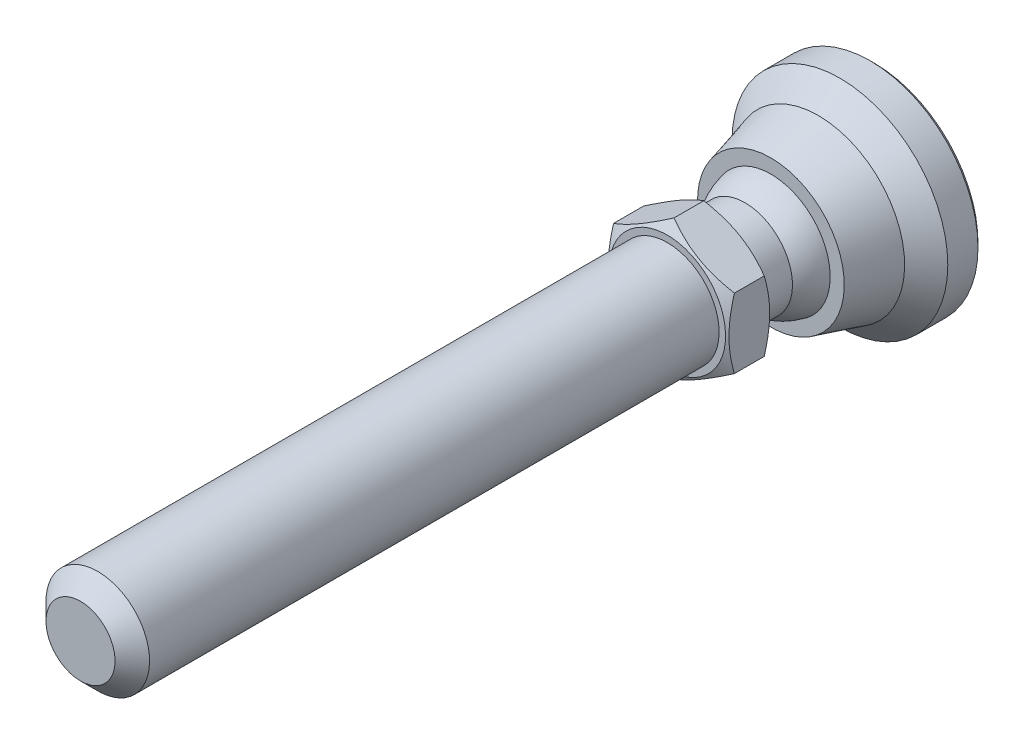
ISO-10303-21;
HEADER;
FILE_DESCRIPTION(('STEP AP214'),'2;1');
FILE_NAME('part.step','',(''),(''),'','','');
FILE_SCHEMA(('AUTOMOTIVE_DESIGN { 1 0 10303 214 1 1 1 1 }'));
ENDSEC;
DATA;
#1=APPLICATION_CONTEXT('core data for automotive mechanical design processes');
#2=APPLICATION_PROTOCOL_DEFINITION('international standard','automotive_design',2000,#1);
#3=PRODUCT_CONTEXT('',#1,'mechanical');
#4=PRODUCT('Part','Part','',(#3));
#5=PRODUCT_RELATED_PRODUCT_CATEGORY('part','',(#4));
#6=PRODUCT_DEFINITION_FORMATION('','',#4);
#7=PRODUCT_DEFINITION_CONTEXT('part definition',#1,'design');
#8=PRODUCT_DEFINITION('design','',#6,#7);
#9=PRODUCT_DEFINITION_SHAPE('','',#8);
#10=(LENGTH_UNIT() NAMED_UNIT(*) SI_UNIT(.MILLI.,.METRE.));
#11=(NAMED_UNIT(*) PLANE_ANGLE_UNIT() SI_UNIT($,.RADIAN.));
#12=(NAMED_UNIT(*) SI_UNIT($,.STERADIAN.) SOLID_ANGLE_UNIT());
#13=UNCERTAINTY_MEASURE_WITH_UNIT(LENGTH_MEASURE(1.E-05),#10,'distance_accuracy_value','');
#14=(GEOMETRIC_REPRESENTATION_CONTEXT(3) GLOBAL_UNCERTAINTY_ASSIGNED_CONTEXT((#13)) GLOBAL_UNIT_ASSIGNED_CONTEXT((#10,
#11,#12)) REPRESENTATION_CONTEXT('',''));
#15=CARTESIAN_POINT('',(0.,0.,0.));
#16=DIRECTION('',(0.,0.,1.));
#17=DIRECTION('',(1.,0.,0.));
#18=AXIS2_PLACEMENT_3D('',#15,#16,#17);
#19=CARTESIAN_POINT('',(1.11022302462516E-13,0.,10.6698729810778));
#20=DIRECTION('',(0.,0.,-1.));
#21=DIRECTION('',(-1.,0.,0.));
#22=AXIS2_PLACEMENT_3D('',#19,#20,#21);
#23=SPHERICAL_SURFACE('',#22,7.);
#24=CARTESIAN_POINT('',(0.,0.,12.));
#25=DIRECTION('',(0.,0.,-1.));
#26=DIRECTION('',(0.,1.,0.));
#27=AXIS2_PLACEMENT_3D('',#24,#25,#26);
#28=CIRCLE('',#27,6.87246404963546);
#29=CARTESIAN_POINT('',(-6.87246404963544,0.,12.));
#30=VERTEX_POINT('',#29);
#31=EDGE_CURVE('E27',#30,#30,#28,.T.);
#32=CARTESIAN_POINT('',(0.,0.,15.));
#33=DIRECTION('',(0.,0.,-1.));
#34=DIRECTION('',(0.,1.,0.));
#35=AXIS2_PLACEMENT_3D('',#32,#33,#34);
#36=CIRCLE('',#35,5.49999999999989);
#37=CARTESIAN_POINT('',(-5.49999999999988,0.,15.));
#38=VERTEX_POINT('',#37);
#39=EDGE_CURVE('E95',#38,#38,#36,.T.);
#40=CARTESIAN_POINT('',(-6.87246404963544,0.,12.));
#41=CARTESIAN_POINT('',(-6.86587210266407,0.,12.0340591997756));
#42=CARTESIAN_POINT('',(-6.85902692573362,0.,12.0680693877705));
#43=CARTESIAN_POINT('',(-6.84483171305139,0.,12.1359842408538));
#44=CARTESIAN_POINT('',(-6.83748167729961,0.,12.1698889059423));
#45=CARTESIAN_POINT('',(-6.82227834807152,0.,12.2375852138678));
#46=CARTESIAN_POINT('',(-6.81442505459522,0.,12.2713768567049));
#47=CARTESIAN_POINT('',(-6.79821695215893,0.,12.3388396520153));
#48=CARTESIAN_POINT('',(-6.78986214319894,0.,12.3725108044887));
#49=CARTESIAN_POINT('',(-6.77265285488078,0.,12.4397251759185));
#50=CARTESIAN_POINT('',(-6.76379837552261,0.,12.473268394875));
#51=CARTESIAN_POINT('',(-6.7455917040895,0.,12.5402194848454));
#52=CARTESIAN_POINT('',(-6.73623951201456,0.,12.5736273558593));
#53=CARTESIAN_POINT('',(-6.71703948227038,0.,12.6403003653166));
#54=CARTESIAN_POINT('',(-6.70719164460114,0.,12.67356550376));
#55=CARTESIAN_POINT('',(-6.68700250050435,0.,12.7399456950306));
#56=CARTESIAN_POINT('',(-6.6766611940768,0.,12.7730607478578));
#57=CARTESIAN_POINT('',(-6.65548739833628,0.,12.8391334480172));
#58=CARTESIAN_POINT('',(-6.64465490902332,0.,12.8720910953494));
#59=CARTESIAN_POINT('',(-6.62250114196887,0.,12.9378416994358));
#60=CARTESIAN_POINT('',(-6.61117986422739,0.,12.9706346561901));
#61=CARTESIAN_POINT('',(-6.58805102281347,0.,13.0360486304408));
#62=CARTESIAN_POINT('',(-6.57624345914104,0.,13.0686696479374));
#63=CARTESIAN_POINT('',(-6.55214465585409,0.,13.1337325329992));
#64=CARTESIAN_POINT('',(-6.53985341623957,0.,13.1661744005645));
#65=CARTESIAN_POINT('',(-6.51478997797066,0.,13.2308718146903));
#66=CARTESIAN_POINT('',(-6.50201777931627,0.,13.2631273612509));
#67=CARTESIAN_POINT('',(-6.47599524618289,0.,13.3274450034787));
#68=CARTESIAN_POINT('',(-6.46274491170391,0.,13.3595070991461));
#69=CARTESIAN_POINT('',(-6.43576903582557,0.,13.4234307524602));
#70=CARTESIAN_POINT('',(-6.42204349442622,0.,13.455292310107));
#71=CARTESIAN_POINT('',(-6.3941202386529,0.,13.5188078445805));
#72=CARTESIAN_POINT('',(-6.37992252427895,0.,13.5504618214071));
#73=CARTESIAN_POINT('',(-6.3510580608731,0.,13.6135551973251));
#74=CARTESIAN_POINT('',(-6.33639131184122,0.,13.6449945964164));
#75=CARTESIAN_POINT('',(-6.3065920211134,0.,13.7076518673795));
#76=CARTESIAN_POINT('',(-6.29145947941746,0.,13.7388697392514));
#77=CARTESIAN_POINT('',(-6.26073194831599,0.,13.8010770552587));
#78=CARTESIAN_POINT('',(-6.24513695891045,0.,13.8320664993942));
#79=CARTESIAN_POINT('',(-6.21348797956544,0.,13.8938101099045));
#80=CARTESIAN_POINT('',(-6.19743398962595,0.,13.9245642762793));
#81=CARTESIAN_POINT('',(-6.16487055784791,0.,13.9858305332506));
#82=CARTESIAN_POINT('',(-6.14836111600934,0.,14.016342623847));
#83=CARTESIAN_POINT('',(-6.11489042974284,0.,14.0771179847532));
#84=CARTESIAN_POINT('',(-6.09792918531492,0.,14.107381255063));
#85=CARTESIAN_POINT('',(-6.06355864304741,0.,14.1676522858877));
#86=CARTESIAN_POINT('',(-6.04614934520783,0.,14.1976600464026));
#87=CARTESIAN_POINT('',(-6.01088654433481,0.,14.2574134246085));
#88=CARTESIAN_POINT('',(-5.99303304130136,0.,14.2871590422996));
#89=CARTESIAN_POINT('',(-5.95688577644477,0.,14.3463815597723));
#90=CARTESIAN_POINT('',(-5.93859201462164,0.,14.3758584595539));
#91=CARTESIAN_POINT('',(-5.9015682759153,0.,14.4345370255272));
#92=CARTESIAN_POINT('',(-5.88283829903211,0.,14.4637386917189));
#93=CARTESIAN_POINT('',(-5.8449462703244,0.,14.5218603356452));
#94=CARTESIAN_POINT('',(-5.82578421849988,0.,14.5507803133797));
#95=CARTESIAN_POINT('',(-5.7870322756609,0.,14.6083321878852));
#96=CARTESIAN_POINT('',(-5.76744238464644,0.,14.6369640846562));
#97=CARTESIAN_POINT('',(-5.72783909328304,0.,14.6939334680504));
#98=CARTESIAN_POINT('',(-5.7078256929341,0.,14.7222709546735));
#99=CARTESIAN_POINT('',(-5.66737980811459,0.,14.778645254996));
#100=CARTESIAN_POINT('',(-5.64694732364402,0.,14.8066820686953));
#101=CARTESIAN_POINT('',(-5.60566778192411,0.,14.862448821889));
#102=CARTESIAN_POINT('',(-5.58482072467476,0.,14.8901787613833));
#103=CARTESIAN_POINT('',(-5.54271666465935,0.,14.9453256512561));
#104=CARTESIAN_POINT('',(-5.52145966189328,0.,14.9727426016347));
#105=CARTESIAN_POINT('',(-5.49999999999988,0.,15.));
#106=B_SPLINE_CURVE_WITH_KNOTS('',3,(#40,#41,#42,#43,#44,#45,#46,#47,#48,#49,#50,#51,#52,#53,
#54,#55,#56,#57,#58,#59,#60,#61,#62,#63,#64,#65,#66,#67,#68,#69,#70,#71,#72,#73,#74,#75,#76,#77,
#78,#79,#80,#81,#82,#83,#84,#85,#86,#87,#88,#89,#90,#91,#92,#93,#94,#95,#96,#97,#98,#99,#100,
#101,#102,#103,#104,#105),.UNSPECIFIED.,.F.,.F.,(4,2,2,2,2,2,2,2,2,2,2,2,2,2,2,2,2,2,2,2,2,2,2,
2,2,2,2,2,2,2,2,2,4),(0.,0.104072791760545,0.208145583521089,0.312218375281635,
0.416291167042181,0.520363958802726,0.62443675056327,0.728509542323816,0.83258233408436,
0.936655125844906,1.04072791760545,1.144800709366,1.24887350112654,1.35294629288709,
1.45701908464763,1.56109187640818,1.66516466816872,1.76923745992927,1.87331025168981,
1.97738304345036,2.0814558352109,2.18552862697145,2.28960141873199,2.39367421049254,
2.49774700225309,2.60181979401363,2.70589258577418,2.80996537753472,2.91403816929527,
3.01811096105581,3.12218375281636,3.2262565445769,3.33032933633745),.UNSPECIFIED.);
#107=EDGE_CURVE('BSEAM14',#30,#38,#106,.T.);
#108=ORIENTED_EDGE('',*,*,#31,.F.);
#109=ORIENTED_EDGE('',*,*,#39,.T.);
#110=ORIENTED_EDGE('',*,*,#107,.T.);
#111=ORIENTED_EDGE('',*,*,#107,.F.);
#112=EDGE_LOOP('',(#108,#110,#109,#111));
#113=FACE_BOUND('',#112,.T.);
#114=ADVANCED_FACE('F14',(#113),#23,.T.);
#115=CARTESIAN_POINT('',(-8.5,0.,12.));
#116=DIRECTION('',(0.,0.,-1.));
#117=DIRECTION('',(0.,1.,0.));
#118=AXIS2_PLACEMENT_3D('',#115,#116,#117);
#119=PLANE('',#118);
#120=CARTESIAN_POINT('',(0.,0.,12.));
#121=DIRECTION('',(0.,0.,-1.));
#122=DIRECTION('',(0.,1.,0.));
#123=AXIS2_PLACEMENT_3D('',#120,#121,#122);
#124=CIRCLE('',#123,8.5);
#125=CARTESIAN_POINT('',(0.,8.5,12.));
#126=VERTEX_POINT('',#125);
#127=EDGE_CURVE('E122',#126,#126,#124,.T.);
#128=ORIENTED_EDGE('',*,*,#127,.F.);
#129=EDGE_LOOP('',(#128));
#130=FACE_BOUND('',#129,.T.);
#131=ORIENTED_EDGE('',*,*,#31,.T.);
#132=EDGE_LOOP('',(#131));
#133=FACE_BOUND('',#132,.T.);
#134=ADVANCED_FACE('F127',(#130,#133),#119,.F.);
#135=CARTESIAN_POINT('',(0.,0.,12.));
#136=DIRECTION('',(0.,0.,-1.));
#137=DIRECTION('',(0.,1.,0.));
#138=AXIS2_PLACEMENT_3D('',#135,#136,#137);
#139=CONICAL_SURFACE('',#138,8.5,0.266252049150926);
#140=CARTESIAN_POINT('',(0.,0.,6.5));
#141=DIRECTION('',(0.,0.,-1.));
#142=DIRECTION('',(0.,1.,0.));
#143=AXIS2_PLACEMENT_3D('',#140,#141,#142);
#144=CIRCLE('',#143,10.);
#145=CARTESIAN_POINT('',(0.,10.,6.5));
#146=VERTEX_POINT('',#145);
#147=EDGE_CURVE('E119',#146,#146,#144,.T.);
#148=ORIENTED_EDGE('',*,*,#147,.F.);
#149=EDGE_LOOP('',(#148));
#150=FACE_BOUND('',#149,.T.);
#151=ORIENTED_EDGE('',*,*,#127,.T.);
#152=EDGE_LOOP('',(#151));
#153=FACE_BOUND('',#152,.T.);
#154=ADVANCED_FACE('F182',(#150,#153),#139,.T.);
#155=CARTESIAN_POINT('',(0.,0.,6.5));
#156=DIRECTION('',(0.,0.,-1.));
#157=DIRECTION('',(0.,1.,0.));
#158=AXIS2_PLACEMENT_3D('',#155,#156,#157);
#159=CONICAL_SURFACE('',#158,10.,0.785398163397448);
#160=CARTESIAN_POINT('',(0.,0.,4.));
#161=DIRECTION('',(0.,0.,-1.));
#162=DIRECTION('',(0.,1.,0.));
#163=AXIS2_PLACEMENT_3D('',#160,#161,#162);
#164=CIRCLE('',#163,12.5);
#165=CARTESIAN_POINT('',(0.,12.5,4.));
#166=VERTEX_POINT('',#165);
#167=EDGE_CURVE('E116',#166,#166,#164,.T.);
#168=ORIENTED_EDGE('',*,*,#167,.F.);
#169=EDGE_LOOP('',(#168));
#170=FACE_BOUND('',#169,.T.);
#171=ORIENTED_EDGE('',*,*,#147,.T.);
#172=EDGE_LOOP('',(#171));
#173=FACE_BOUND('',#172,.T.);
#174=ADVANCED_FACE('F178',(#170,#173),#159,.T.);
#175=CARTESIAN_POINT('',(0.,0.,0.));
#176=DIRECTION('',(0.,0.,-1.));
#177=DIRECTION('',(0.,1.,0.));
#178=AXIS2_PLACEMENT_3D('',#175,#176,#177);
#179=CYLINDRICAL_SURFACE('',#178,12.5);
#180=CARTESIAN_POINT('',(0.,0.,0.5));
#181=DIRECTION('',(0.,0.,-1.));
#182=DIRECTION('',(0.,1.,0.));
#183=AXIS2_PLACEMENT_3D('',#180,#181,#182);
#184=CIRCLE('',#183,12.5);
#185=CARTESIAN_POINT('',(0.,12.5,0.5));
#186=VERTEX_POINT('',#185);
#187=EDGE_CURVE('E113',#186,#186,#184,.T.);
#188=ORIENTED_EDGE('',*,*,#187,.F.);
#189=EDGE_LOOP('',(#188));
#190=FACE_BOUND('',#189,.T.);
#191=ORIENTED_EDGE('',*,*,#167,.T.);
#192=EDGE_LOOP('',(#191));
#193=FACE_BOUND('',#192,.T.);
#194=ADVANCED_FACE('F174',(#190,#193),#179,.T.);
#195=CARTESIAN_POINT('',(0.,0.,0.5));
#196=DIRECTION('',(0.,0.,1.));
#197=DIRECTION('',(0.,-1.,0.));
#198=AXIS2_PLACEMENT_3D('',#195,#196,#197);
#199=CONICAL_SURFACE('',#198,12.5,0.785398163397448);
#200=CARTESIAN_POINT('',(0.,0.,0.));
#201=DIRECTION('',(0.,0.,-1.));
#202=DIRECTION('',(0.,1.,0.));
#203=AXIS2_PLACEMENT_3D('',#200,#201,#202);
#204=CIRCLE('',#203,12.);
#205=CARTESIAN_POINT('',(0.,12.,0.));
#206=VERTEX_POINT('',#205);
#207=EDGE_CURVE('E110',#206,#206,#204,.T.);
#208=ORIENTED_EDGE('',*,*,#207,.F.);
#209=EDGE_LOOP('',(#208));
#210=FACE_BOUND('',#209,.T.);
#211=ORIENTED_EDGE('',*,*,#187,.T.);
#212=EDGE_LOOP('',(#211));
#213=FACE_BOUND('',#212,.T.);
#214=ADVANCED_FACE('F149',(#210,#213),#199,.T.);
#215=CARTESIAN_POINT('',(-12.,0.,0.));
#216=DIRECTION('',(0.,0.,1.));
#217=DIRECTION('',(0.,-1.,0.));
#218=AXIS2_PLACEMENT_3D('',#215,#216,#217);
#219=PLANE('',#218);
#220=ORIENTED_EDGE('',*,*,#207,.T.);
#221=EDGE_LOOP('',(#220));
#222=FACE_BOUND('',#221,.T.);
#223=ADVANCED_FACE('F141',(#222),#219,.F.);
#224=CARTESIAN_POINT('',(-5.49999999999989,0.,18.9999999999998));
#225=DIRECTION('',(0.,0.,1.));
#226=DIRECTION('',(0.,-1.,0.));
#227=AXIS2_PLACEMENT_3D('',#224,#225,#226);
#228=PLANE('',#227);
#229=CARTESIAN_POINT('',(0.,0.,18.9999999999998));
#230=DIRECTION('',(0.,0.,1.));
#231=DIRECTION('',(0.,-1.,0.));
#232=AXIS2_PLACEMENT_3D('',#229,#230,#231);
#233=CIRCLE('',#232,6.75);
#234=CARTESIAN_POINT('',(0.,-6.75,18.9999999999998));
#235=VERTEX_POINT('',#234);
#236=EDGE_CURVE('E427',#235,#235,#233,.T.);
#237=ORIENTED_EDGE('',*,*,#236,.F.);
#238=EDGE_LOOP('',(#237));
#239=FACE_BOUND('',#238,.T.);
#240=CARTESIAN_POINT('',(0.,0.,18.9999999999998));
#241=DIRECTION('',(0.,0.,-1.));
#242=DIRECTION('',(0.,1.,0.));
#243=AXIS2_PLACEMENT_3D('',#240,#241,#242);
#244=CIRCLE('',#243,5.49999999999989);
#245=CARTESIAN_POINT('',(0.,5.49999999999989,18.9999999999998));
#246=VERTEX_POINT('',#245);
#247=EDGE_CURVE('E98',#246,#246,#244,.T.);
#248=ORIENTED_EDGE('',*,*,#247,.F.);
#249=EDGE_LOOP('',(#248));
#250=FACE_BOUND('',#249,.T.);
#251=ADVANCED_FACE('F136',(#239,#250),#228,.F.);
#252=CARTESIAN_POINT('',(0.,0.,0.));
#253=DIRECTION('',(0.,0.,-1.));
#254=DIRECTION('',(0.,1.,0.));
#255=AXIS2_PLACEMENT_3D('',#252,#253,#254);
#256=CYLINDRICAL_SURFACE('',#255,5.49999999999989);
#257=ORIENTED_EDGE('',*,*,#39,.F.);
#258=EDGE_LOOP('',(#257));
#259=FACE_BOUND('',#258,.T.);
#260=ORIENTED_EDGE('',*,*,#247,.T.);
#261=EDGE_LOOP('',(#260));
#262=FACE_BOUND('',#261,.T.);
#263=ADVANCED_FACE('F133',(#259,#262),#256,.T.);
#264=CARTESIAN_POINT('',(0.,0.,18.9999999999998));
#265=DIRECTION('',(0.,0.,1.));
#266=DIRECTION('',(0.,-1.,0.));
#267=AXIS2_PLACEMENT_3D('',#264,#265,#266);
#268=CONICAL_SURFACE('',#267,6.75,1.0471975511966);
#269=CARTESIAN_POINT('',(0.000200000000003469,-8.0830192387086,19.7696190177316));
#270=CARTESIAN_POINT('',(-0.15366790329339,-7.99418356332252,19.7183374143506));
#271=CARTESIAN_POINT('',(-0.308109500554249,-7.90501666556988,19.6693831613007));
#272=CARTESIAN_POINT('',(-0.618246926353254,-7.72595873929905,19.5767703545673));
#273=CARTESIAN_POINT('',(-0.773943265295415,-7.63606741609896,19.5331140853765));
#274=CARTESIAN_POINT('',(-1.24352516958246,-7.36495417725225,19.4109491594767));
#275=CARTESIAN_POINT('',(-1.5592643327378,-7.18266208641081,19.3414631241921));
#276=CARTESIAN_POINT('',(-2.03176224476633,-6.90986528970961,19.2599825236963));
#277=CARTESIAN_POINT('',(-2.18710922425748,-6.82017566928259,19.2367710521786));
#278=CARTESIAN_POINT('',(-2.49850511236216,-6.64039116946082,19.1978487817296));
#279=CARTESIAN_POINT('',(-2.6545539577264,-6.55029632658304,19.1821373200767));
#280=CARTESIAN_POINT('',(-2.96692267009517,-6.36995016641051,19.1586154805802));
#281=CARTESIAN_POINT('',(-3.12324202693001,-6.27969914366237,19.15079613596));
#282=CARTESIAN_POINT('',(-3.43601650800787,-6.09911871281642,19.1432178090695));
#283=CARTESIAN_POINT('',(-3.59247162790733,-6.00878930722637,19.1434585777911));
#284=CARTESIAN_POINT('',(-4.02110687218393,-5.76131663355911,19.1551972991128));
#285=CARTESIAN_POINT('',(-4.29314668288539,-5.60425437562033,19.1749033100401));
#286=CARTESIAN_POINT('',(-4.83541944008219,-5.29117305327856,19.2373910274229));
#287=CARTESIAN_POINT('',(-5.10565047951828,-5.13515508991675,19.2801940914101));
#288=CARTESIAN_POINT('',(-5.64901454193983,-4.82144370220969,19.3871892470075));
#289=CARTESIAN_POINT('',(-5.92207900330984,-4.6637898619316,19.4518346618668));
#290=CARTESIAN_POINT('',(-6.46413578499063,-4.35083323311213,19.5985536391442));
#291=CARTESIAN_POINT('',(-6.73313504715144,-4.19552643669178,19.6805927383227));
#292=CARTESIAN_POINT('',(-7.0002,-4.04133641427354,19.7696190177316));
#293=B_SPLINE_CURVE_WITH_KNOTS('',3,(#269,#270,#271,#272,#273,#274,#275,#276,#277,#278,#279,
#280,#281,#282,#283,#284,#285,#286,#287,#288,#289,#290,#291,#292),.UNSPECIFIED.,.F.,.F.,(4,2,2,
2,2,2,2,2,2,2,2,4),(0.,0.554727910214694,1.10969417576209,2.2219327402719,2.76443041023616,
3.30688013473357,3.84871284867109,4.39052882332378,5.33376515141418,6.27787517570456,
7.2429241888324,8.20607866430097),.UNSPECIFIED.);
#294=CARTESIAN_POINT('',(0.,-8.08290376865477,19.7695523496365));
#295=VERTEX_POINT('',#294);
#296=CARTESIAN_POINT('',(-7.,-4.04145188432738,19.7695523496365));
#297=VERTEX_POINT('',#296);
#298=EDGE_CURVE('E72',#295,#297,#293,.T.);
#299=ORIENTED_EDGE('',*,*,#298,.T.);
#300=CARTESIAN_POINT('',(-7.,10.8691501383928,22.566986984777));
#301=CARTESIAN_POINT('',(-7.,10.5633015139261,22.4185694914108));
#302=CARTESIAN_POINT('',(-7.,10.2567522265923,22.2715712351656));
#303=CARTESIAN_POINT('',(-7.,9.64187975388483,21.9812111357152));
#304=CARTESIAN_POINT('',(-7.,9.33355629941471,21.8378498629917));
#305=CARTESIAN_POINT('',(-7.,8.71318075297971,21.5548432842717));
#306=CARTESIAN_POINT('',(-7.,8.40111750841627,21.4152223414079));
#307=CARTESIAN_POINT('',(-7.,7.77451368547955,21.1416764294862));
#308=CARTESIAN_POINT('',(-7.,7.45997322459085,21.0077511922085));
#309=CARTESIAN_POINT('',(-7.,6.81771160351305,20.7428925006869));
#310=CARTESIAN_POINT('',(-7.,6.48989260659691,20.6121949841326));
#311=CARTESIAN_POINT('',(-7.,5.83042507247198,20.3606593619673));
#312=CARTESIAN_POINT('',(-7.,5.49877611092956,20.2398223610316));
#313=CARTESIAN_POINT('',(-7.,4.8317334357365,20.0111705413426));
#314=CARTESIAN_POINT('',(-7.,4.49634881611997,19.9033294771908));
#315=CARTESIAN_POINT('',(-7.,3.82078061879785,19.7041197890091));
#316=CARTESIAN_POINT('',(-7.,3.48059858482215,19.612745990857));
#317=CARTESIAN_POINT('',(-7.,2.79707632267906,19.451339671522));
#318=CARTESIAN_POINT('',(-7.,2.45376429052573,19.3811909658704));
#319=CARTESIAN_POINT('',(-7.,1.93565887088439,19.2949168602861));
#320=CARTESIAN_POINT('',(-7.,1.76242135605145,19.2693158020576));
#321=CARTESIAN_POINT('',(-7.,1.41508150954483,19.2249319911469));
#322=CARTESIAN_POINT('',(-7.,1.24097926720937,19.206148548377));
#323=CARTESIAN_POINT('',(-7.,0.894422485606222,19.176010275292));
#324=CARTESIAN_POINT('',(-7.,0.721976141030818,19.1645615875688));
#325=CARTESIAN_POINT('',(-7.,0.376753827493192,19.1489675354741));
#326=CARTESIAN_POINT('',(-7.,0.203977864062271,19.144822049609));
#327=CARTESIAN_POINT('',(-7.,-0.141594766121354,19.1439333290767));
#328=CARTESIAN_POINT('',(-7.,-0.31439143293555,19.1471901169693));
#329=CARTESIAN_POINT('',(-7.,-0.659693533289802,19.1610261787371));
#330=CARTESIAN_POINT('',(-7.,-0.832198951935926,19.1716058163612));
#331=CARTESIAN_POINT('',(-7.,-1.24637409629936,19.2055737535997));
#332=CARTESIAN_POINT('',(-7.,-1.48776673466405,19.2324138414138));
#333=CARTESIAN_POINT('',(-7.,-1.96875783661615,19.2989718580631));
#334=CARTESIAN_POINT('',(-7.,-2.20835605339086,19.3386915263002));
#335=CARTESIAN_POINT('',(-7.,-2.92418639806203,19.4750635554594));
#336=CARTESIAN_POINT('',(-7.,-3.39718719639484,19.5889041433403));
#337=CARTESIAN_POINT('',(-7.,-4.10447184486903,19.7862883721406));
#338=CARTESIAN_POINT('',(-7.,-4.34242483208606,19.8574403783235));
#339=CARTESIAN_POINT('',(-7.,-4.81601960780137,20.0071284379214));
#340=CARTESIAN_POINT('',(-7.,-5.05166138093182,20.0856645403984));
#341=CARTESIAN_POINT('',(-7.,-5.52070800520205,20.248861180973));
#342=CARTESIAN_POINT('',(-7.,-5.75411356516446,20.3335197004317));
#343=CARTESIAN_POINT('',(-7.,-6.21899117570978,20.5079656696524));
#344=CARTESIAN_POINT('',(-7.,-6.45046324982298,20.5977530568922));
#345=CARTESIAN_POINT('',(-7.,-7.00025789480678,20.816909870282));
#346=CARTESIAN_POINT('',(-7.,-7.31779799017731,20.9482387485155));
#347=CARTESIAN_POINT('',(-7.,-7.95014907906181,21.2173292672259));
#348=CARTESIAN_POINT('',(-7.,-8.26495989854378,21.3550913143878));
#349=CARTESIAN_POINT('',(-7.,-8.892359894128,21.6357445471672));
#350=CARTESIAN_POINT('',(-7.,-9.20494859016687,21.7786368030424));
#351=CARTESIAN_POINT('',(-7.,-9.8282258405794,22.0685143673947));
#352=CARTESIAN_POINT('',(-7.,-10.1389143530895,22.2154997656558));
#353=CARTESIAN_POINT('',(-7.,-10.7590387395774,22.5129486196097));
#354=CARTESIAN_POINT('',(-7.,-11.0684728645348,22.6634157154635));
#355=CARTESIAN_POINT('',(-7.,-11.6860013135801,22.9670770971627));
#356=CARTESIAN_POINT('',(-7.,-11.9940956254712,23.1202714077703));
#357=CARTESIAN_POINT('',(-7.,-12.916606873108,23.5831716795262));
#358=CARTESIAN_POINT('',(-7.,-13.5293381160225,23.8962365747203));
#359=CARTESIAN_POINT('',(-7.,-14.6995913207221,24.5017662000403));
#360=CARTESIAN_POINT('',(-7.,-15.2573788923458,24.7937199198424));
#361=CARTESIAN_POINT('',(-7.,-16.370887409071,25.3815884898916));
#362=CARTESIAN_POINT('',(-7.,-16.926608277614,25.6775034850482));
#363=CARTESIAN_POINT('',(-7.,-18.0350262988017,26.2715878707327));
#364=CARTESIAN_POINT('',(-7.,-18.587727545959,26.5697496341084));
#365=CARTESIAN_POINT('',(-7.,-19.6918109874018,27.1684325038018));
#366=CARTESIAN_POINT('',(-7.,-20.2431932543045,27.4689534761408));
#367=CARTESIAN_POINT('',(-7.,-20.7940912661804,27.7703536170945));
#368=B_SPLINE_CURVE_WITH_KNOTS('',3,(#300,#301,#302,#303,#304,#305,#306,#307,#308,#309,#310,
#311,#312,#313,#314,#315,#316,#317,#318,#319,#320,#321,#322,#323,#324,#325,#326,#327,#328,#329,
#330,#331,#332,#333,#334,#335,#336,#337,#338,#339,#340,#341,#342,#343,#344,#345,#346,#347,#348,
#349,#350,#351,#352,#353,#354,#355,#356,#357,#358,#359,#360,#361,#362,#363,#364,#365,#366,#367),
.UNSPECIFIED.,.F.,.F.,(4,2,2,2,2,2,2,2,2,2,2,2,2,2,2,2,2,2,2,2,2,2,2,2,2,2,2,2,2,2,2,2,2,4),(0.,
1.01988502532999,2.03992904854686,3.06550386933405,4.0910303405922,5.14964432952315,
6.20837675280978,7.26493389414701,8.32115847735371,9.37149217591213,9.896736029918,
10.4219267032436,10.9402550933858,11.4585748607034,11.9768962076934,12.4952433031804,
13.2234727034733,13.9518004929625,15.4092569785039,16.1542840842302,16.8993161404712,
17.644103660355,18.3888821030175,19.4196646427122,20.4505124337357,21.4815765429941,
22.5126632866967,23.5448816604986,24.5771094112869,26.6412783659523,28.5299847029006,
30.4187603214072,32.3027425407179,34.1866185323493),.UNSPECIFIED.);
#369=CARTESIAN_POINT('',(-7.,4.04145188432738,19.7695523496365));
#370=VERTEX_POINT('',#369);
#371=EDGE_CURVE('E80',#297,#370,#368,.F.);
#372=ORIENTED_EDGE('',*,*,#371,.T.);
#373=CARTESIAN_POINT('',(-7.0002,4.04133641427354,19.7696190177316));
#374=CARTESIAN_POINT('',(-6.84633209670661,4.13017208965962,19.7183374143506));
#375=CARTESIAN_POINT('',(-6.69189049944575,4.21933898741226,19.6693831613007));
#376=CARTESIAN_POINT('',(-6.38175307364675,4.39839691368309,19.5767703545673));
#377=CARTESIAN_POINT('',(-6.22605673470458,4.48828823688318,19.5331140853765));
#378=CARTESIAN_POINT('',(-5.75647483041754,4.75940147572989,19.4109491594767));
#379=CARTESIAN_POINT('',(-5.4407356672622,4.94169356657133,19.3414631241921));
#380=CARTESIAN_POINT('',(-4.96823775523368,5.21449036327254,19.2599825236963));
#381=CARTESIAN_POINT('',(-4.81289077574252,5.30417998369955,19.2367710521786));
#382=CARTESIAN_POINT('',(-4.50149488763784,5.48396448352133,19.1978487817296));
#383=CARTESIAN_POINT('',(-4.3454460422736,5.57405932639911,19.1821373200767));
#384=CARTESIAN_POINT('',(-4.03307732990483,5.75440548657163,19.1586154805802));
#385=CARTESIAN_POINT('',(-3.87675797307,5.84465650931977,19.15079613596));
#386=CARTESIAN_POINT('',(-3.56398349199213,6.02523694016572,19.1432178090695));
#387=CARTESIAN_POINT('',(-3.40752837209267,6.11556634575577,19.1434585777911));
#388=CARTESIAN_POINT('',(-2.97889312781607,6.36303901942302,19.1551972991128));
#389=CARTESIAN_POINT('',(-2.70685331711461,6.52010127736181,19.1749033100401));
#390=CARTESIAN_POINT('',(-2.16458055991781,6.83318259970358,19.2373910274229));
#391=CARTESIAN_POINT('',(-1.89434952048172,6.9892005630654,19.2801940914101));
#392=CARTESIAN_POINT('',(-1.35098545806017,7.30291195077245,19.3871892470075));
#393=CARTESIAN_POINT('',(-1.07792099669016,7.46056579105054,19.4518346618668));
#394=CARTESIAN_POINT('',(-0.535864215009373,7.77352241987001,19.5985536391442));
#395=CARTESIAN_POINT('',(-0.266864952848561,7.92882921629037,19.6805927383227));
#396=CARTESIAN_POINT('',(0.000199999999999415,8.0830192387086,19.7696190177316));
#397=B_SPLINE_CURVE_WITH_KNOTS('',3,(#373,#374,#375,#376,#377,#378,#379,#380,#381,#382,#383,
#384,#385,#386,#387,#388,#389,#390,#391,#392,#393,#394,#395,#396),.UNSPECIFIED.,.F.,.F.,(4,2,2,
2,2,2,2,2,2,2,2,4),(0.,0.554727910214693,1.10969417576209,2.22193274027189,2.76443041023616,
3.30688013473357,3.84871284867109,4.39052882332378,5.33376515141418,6.27787517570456,
7.2429241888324,8.20607866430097),.UNSPECIFIED.);
#398=CARTESIAN_POINT('',(0.,8.08290376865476,19.7695523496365));
#399=VERTEX_POINT('',#398);
#400=EDGE_CURVE('E382',#370,#399,#397,.T.);
#401=ORIENTED_EDGE('',*,*,#400,.T.);
#402=CARTESIAN_POINT('',(-0.000200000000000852,8.0830192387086,19.7696190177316));
#403=CARTESIAN_POINT('',(0.153667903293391,7.99418356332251,19.7183374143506));
#404=CARTESIAN_POINT('',(0.308109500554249,7.90501666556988,19.6693831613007));
#405=CARTESIAN_POINT('',(0.618246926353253,7.72595873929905,19.5767703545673));
#406=CARTESIAN_POINT('',(0.773943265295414,7.63606741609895,19.5331140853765));
#407=CARTESIAN_POINT('',(1.24352516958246,7.36495417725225,19.4109491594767));
#408=CARTESIAN_POINT('',(1.5592643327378,7.18266208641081,19.3414631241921));
#409=CARTESIAN_POINT('',(2.03176224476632,6.9098652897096,19.2599825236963));
#410=CARTESIAN_POINT('',(2.18710922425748,6.82017566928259,19.2367710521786));
#411=CARTESIAN_POINT('',(2.49850511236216,6.64039116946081,19.1978487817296));
#412=CARTESIAN_POINT('',(2.6545539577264,6.55029632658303,19.1821373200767));
#413=CARTESIAN_POINT('',(2.96692267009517,6.36995016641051,19.1586154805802));
#414=CARTESIAN_POINT('',(3.12324202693,6.27969914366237,19.15079613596));
#415=CARTESIAN_POINT('',(3.43601650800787,6.09911871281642,19.1432178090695));
#416=CARTESIAN_POINT('',(3.59247162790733,6.00878930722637,19.1434585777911));
#417=CARTESIAN_POINT('',(4.02110687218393,5.76131663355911,19.1551972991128));
#418=CARTESIAN_POINT('',(4.29314668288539,5.60425437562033,19.1749033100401));
#419=CARTESIAN_POINT('',(4.83541944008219,5.29117305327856,19.2373910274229));
#420=CARTESIAN_POINT('',(5.10565047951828,5.13515508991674,19.2801940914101));
#421=CARTESIAN_POINT('',(5.64901454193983,4.82144370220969,19.3871892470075));
#422=CARTESIAN_POINT('',(5.92207900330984,4.66378986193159,19.4518346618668));
#423=CARTESIAN_POINT('',(6.46413578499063,4.35083323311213,19.5985536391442));
#424=CARTESIAN_POINT('',(6.73313504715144,4.19552643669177,19.6805927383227));
#425=CARTESIAN_POINT('',(7.0002,4.04133641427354,19.7696190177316));
#426=B_SPLINE_CURVE_WITH_KNOTS('',3,(#402,#403,#404,#405,#406,#407,#408,#409,#410,#411,#412,
#413,#414,#415,#416,#417,#418,#419,#420,#421,#422,#423,#424,#425),.UNSPECIFIED.,.F.,.F.,(4,2,2,
2,2,2,2,2,2,2,2,4),(0.,0.554727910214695,1.10969417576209,2.22193274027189,2.76443041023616,
3.30688013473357,3.84871284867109,4.39052882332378,5.33376515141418,6.27787517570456,
7.2429241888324,8.20607866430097),.UNSPECIFIED.);
#427=CARTESIAN_POINT('',(7.,4.04145188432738,19.7695523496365));
#428=VERTEX_POINT('',#427);
#429=EDGE_CURVE('E377',#399,#428,#426,.T.);
#430=ORIENTED_EDGE('',*,*,#429,.T.);
#431=CARTESIAN_POINT('',(7.,10.8691501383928,22.566986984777));
#432=CARTESIAN_POINT('',(7.,10.5633015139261,22.4185694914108));
#433=CARTESIAN_POINT('',(7.,10.2567522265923,22.2715712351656));
#434=CARTESIAN_POINT('',(7.,9.64187975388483,21.9812111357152));
#435=CARTESIAN_POINT('',(7.,9.3335562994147,21.8378498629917));
#436=CARTESIAN_POINT('',(7.,8.7131807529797,21.5548432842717));
#437=CARTESIAN_POINT('',(7.,8.40111750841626,21.4152223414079));
#438=CARTESIAN_POINT('',(7.,7.77451368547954,21.1416764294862));
#439=CARTESIAN_POINT('',(7.,7.45997322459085,21.0077511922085));
#440=CARTESIAN_POINT('',(7.,6.81771160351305,20.7428925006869));
#441=CARTESIAN_POINT('',(7.,6.48989260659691,20.6121949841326));
#442=CARTESIAN_POINT('',(7.,5.83042507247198,20.3606593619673));
#443=CARTESIAN_POINT('',(7.,5.49877611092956,20.2398223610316));
#444=CARTESIAN_POINT('',(7.,4.8317334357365,20.0111705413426));
#445=CARTESIAN_POINT('',(7.,4.49634881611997,19.9033294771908));
#446=CARTESIAN_POINT('',(7.,3.82078061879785,19.7041197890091));
#447=CARTESIAN_POINT('',(7.,3.48059858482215,19.612745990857));
#448=CARTESIAN_POINT('',(7.,2.79707632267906,19.451339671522));
#449=CARTESIAN_POINT('',(7.,2.45376429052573,19.3811909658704));
#450=CARTESIAN_POINT('',(7.,1.93565887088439,19.2949168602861));
#451=CARTESIAN_POINT('',(7.,1.76242135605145,19.2693158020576));
#452=CARTESIAN_POINT('',(7.,1.41508150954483,19.2249319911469));
#453=CARTESIAN_POINT('',(7.,1.24097926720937,19.206148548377));
#454=CARTESIAN_POINT('',(7.,0.894422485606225,19.176010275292));
#455=CARTESIAN_POINT('',(7.,0.721976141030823,19.1645615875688));
#456=CARTESIAN_POINT('',(7.,0.376753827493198,19.1489675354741));
#457=CARTESIAN_POINT('',(7.,0.203977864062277,19.144822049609));
#458=CARTESIAN_POINT('',(7.,-0.141594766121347,19.1439333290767));
#459=CARTESIAN_POINT('',(7.,-0.314391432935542,19.1471901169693));
#460=CARTESIAN_POINT('',(7.,-0.659693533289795,19.1610261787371));
#461=CARTESIAN_POINT('',(7.,-0.83219895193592,19.1716058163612));
#462=CARTESIAN_POINT('',(7.,-1.24637409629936,19.2055737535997));
#463=CARTESIAN_POINT('',(7.,-1.48776673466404,19.2324138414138));
#464=CARTESIAN_POINT('',(7.,-1.96875783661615,19.2989718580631));
#465=CARTESIAN_POINT('',(7.,-2.20835605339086,19.3386915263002));
#466=CARTESIAN_POINT('',(7.,-2.92418639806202,19.4750635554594));
#467=CARTESIAN_POINT('',(7.,-3.39718719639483,19.5889041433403));
#468=CARTESIAN_POINT('',(7.,-4.10447184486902,19.7862883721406));
#469=CARTESIAN_POINT('',(7.,-4.34242483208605,19.8574403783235));
#470=CARTESIAN_POINT('',(7.,-4.81601960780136,20.0071284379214));
#471=CARTESIAN_POINT('',(7.,-5.05166138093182,20.0856645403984));
#472=CARTESIAN_POINT('',(7.,-5.52070800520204,20.248861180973));
#473=CARTESIAN_POINT('',(7.,-5.75411356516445,20.3335197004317));
#474=CARTESIAN_POINT('',(7.,-6.21899117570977,20.5079656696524));
#475=CARTESIAN_POINT('',(7.,-6.45046324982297,20.5977530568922));
#476=CARTESIAN_POINT('',(7.,-7.00025789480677,20.816909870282));
#477=CARTESIAN_POINT('',(7.,-7.3177979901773,20.9482387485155));
#478=CARTESIAN_POINT('',(7.,-7.95014907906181,21.2173292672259));
#479=CARTESIAN_POINT('',(7.,-8.26495989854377,21.3550913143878));
#480=CARTESIAN_POINT('',(7.,-8.89235989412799,21.6357445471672));
#481=CARTESIAN_POINT('',(7.,-9.20494859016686,21.7786368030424));
#482=CARTESIAN_POINT('',(7.,-9.82822584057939,22.0685143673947));
#483=CARTESIAN_POINT('',(7.,-10.1389143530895,22.2154997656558));
#484=CARTESIAN_POINT('',(7.,-10.7590387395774,22.5129486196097));
#485=CARTESIAN_POINT('',(7.,-11.0684728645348,22.6634157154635));
#486=CARTESIAN_POINT('',(7.,-11.6860013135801,22.9670770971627));
#487=CARTESIAN_POINT('',(7.,-11.9940956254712,23.1202714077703));
#488=CARTESIAN_POINT('',(7.,-12.916606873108,23.5831716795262));
#489=CARTESIAN_POINT('',(7.,-13.5293381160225,23.8962365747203));
#490=CARTESIAN_POINT('',(7.,-14.6995913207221,24.5017662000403));
#491=CARTESIAN_POINT('',(7.,-15.2573788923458,24.7937199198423));
#492=CARTESIAN_POINT('',(7.,-16.370887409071,25.3815884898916));
#493=CARTESIAN_POINT('',(7.,-16.926608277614,25.6775034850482));
#494=CARTESIAN_POINT('',(7.,-18.0350262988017,26.2715878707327));
#495=CARTESIAN_POINT('',(7.,-18.587727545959,26.5697496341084));
#496=CARTESIAN_POINT('',(7.,-19.6918109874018,27.1684325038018));
#497=CARTESIAN_POINT('',(7.,-20.2431932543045,27.4689534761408));
#498=CARTESIAN_POINT('',(7.,-20.7940912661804,27.7703536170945));
#499=B_SPLINE_CURVE_WITH_KNOTS('',3,(#431,#432,#433,#434,#435,#436,#437,#438,#439,#440,#441,
#442,#443,#444,#445,#446,#447,#448,#449,#450,#451,#452,#453,#454,#455,#456,#457,#458,#459,#460,
#461,#462,#463,#464,#465,#466,#467,#468,#469,#470,#471,#472,#473,#474,#475,#476,#477,#478,#479,
#480,#481,#482,#483,#484,#485,#486,#487,#488,#489,#490,#491,#492,#493,#494,#495,#496,#497,#498),
.UNSPECIFIED.,.F.,.F.,(4,2,2,2,2,2,2,2,2,2,2,2,2,2,2,2,2,2,2,2,2,2,2,2,2,2,2,2,2,2,2,2,2,4),(0.,
1.01988502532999,2.03992904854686,3.06550386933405,4.0910303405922,5.14964432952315,
6.20837675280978,7.26493389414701,8.32115847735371,9.37149217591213,9.896736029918,
10.4219267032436,10.9402550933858,11.4585748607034,11.9768962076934,12.4952433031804,
13.2234727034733,13.9518004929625,15.4092569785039,16.1542840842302,16.8993161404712,
17.644103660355,18.3888821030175,19.4196646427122,20.4505124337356,21.4815765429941,
22.5126632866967,23.5448816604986,24.5771094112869,26.6412783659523,28.5299847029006,
30.4187603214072,32.3027425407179,34.1866185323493),.UNSPECIFIED.);
#500=CARTESIAN_POINT('',(7.,-4.04145188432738,19.7695523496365));
#501=VERTEX_POINT('',#500);
#502=EDGE_CURVE('E33',#428,#501,#499,.T.);
#503=ORIENTED_EDGE('',*,*,#502,.T.);
#504=CARTESIAN_POINT('',(7.0002,-4.04133641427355,19.7696190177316));
#505=CARTESIAN_POINT('',(6.84633209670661,-4.13017208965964,19.7183374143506));
#506=CARTESIAN_POINT('',(6.69189049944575,-4.21933898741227,19.6693831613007));
#507=CARTESIAN_POINT('',(6.38175307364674,-4.3983969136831,19.5767703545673));
#508=CARTESIAN_POINT('',(6.22605673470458,-4.4882882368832,19.5331140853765));
#509=CARTESIAN_POINT('',(5.75647483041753,-4.7594014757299,19.4109491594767));
#510=CARTESIAN_POINT('',(5.4407356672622,-4.94169356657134,19.3414631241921));
#511=CARTESIAN_POINT('',(4.96823775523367,-5.21449036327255,19.2599825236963));
#512=CARTESIAN_POINT('',(4.81289077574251,-5.30417998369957,19.2367710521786));
#513=CARTESIAN_POINT('',(4.50149488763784,-5.48396448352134,19.1978487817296));
#514=CARTESIAN_POINT('',(4.34544604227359,-5.57405932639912,19.1821373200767));
#515=CARTESIAN_POINT('',(4.03307732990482,-5.75440548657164,19.1586154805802));
#516=CARTESIAN_POINT('',(3.87675797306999,-5.84465650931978,19.15079613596));
#517=CARTESIAN_POINT('',(3.56398349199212,-6.02523694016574,19.1432178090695));
#518=CARTESIAN_POINT('',(3.40752837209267,-6.11556634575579,19.1434585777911));
#519=CARTESIAN_POINT('',(2.97889312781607,-6.36303901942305,19.1551972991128));
#520=CARTESIAN_POINT('',(2.7068533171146,-6.52010127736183,19.1749033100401));
#521=CARTESIAN_POINT('',(2.1645805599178,-6.83318259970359,19.2373910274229));
#522=CARTESIAN_POINT('',(1.89434952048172,-6.98920056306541,19.2801940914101));
#523=CARTESIAN_POINT('',(1.35098545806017,-7.30291195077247,19.3871892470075));
#524=CARTESIAN_POINT('',(1.07792099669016,-7.46056579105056,19.4518346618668));
#525=CARTESIAN_POINT('',(0.535864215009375,-7.77352241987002,19.5985536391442));
#526=CARTESIAN_POINT('',(0.266864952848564,-7.92882921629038,19.6805927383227));
#527=CARTESIAN_POINT('',(-0.000199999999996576,-8.08301923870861,19.7696190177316));
#528=B_SPLINE_CURVE_WITH_KNOTS('',3,(#504,#505,#506,#507,#508,#509,#510,#511,#512,#513,#514,
#515,#516,#517,#518,#519,#520,#521,#522,#523,#524,#525,#526,#527),.UNSPECIFIED.,.F.,.F.,(4,2,2,
2,2,2,2,2,2,2,2,4),(0.,0.554727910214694,1.10969417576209,2.2219327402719,2.76443041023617,
3.30688013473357,3.84871284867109,4.39052882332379,5.33376515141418,6.27787517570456,
7.24292418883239,8.20607866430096),.UNSPECIFIED.);
#529=EDGE_CURVE('E9',#501,#295,#528,.T.);
#530=ORIENTED_EDGE('',*,*,#529,.T.);
#531=EDGE_LOOP('',(#299,#372,#401,#430,#503,#530));
#532=FACE_BOUND('',#531,.T.);
#533=ORIENTED_EDGE('',*,*,#236,.T.);
#534=EDGE_LOOP('',(#533));
#535=FACE_BOUND('',#534,.T.);
#536=ADVANCED_FACE('F70',(#532,#535),#268,.T.);
#537=CARTESIAN_POINT('',(-3.99999999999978,0.,92.));
#538=DIRECTION('',(0.,0.,-1.));
#539=DIRECTION('',(0.,1.,0.));
#540=AXIS2_PLACEMENT_3D('',#537,#538,#539);
#541=PLANE('',#540);
#542=CARTESIAN_POINT('',(0.,0.,92.));
#543=DIRECTION('',(0.,0.,-1.));
#544=DIRECTION('',(0.,1.,0.));
#545=AXIS2_PLACEMENT_3D('',#542,#543,#544);
#546=CIRCLE('',#545,3.99999999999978);
#547=CARTESIAN_POINT('',(0.,3.99999999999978,92.));
#548=VERTEX_POINT('',#547);
#549=EDGE_CURVE('E107',#548,#548,#546,.T.);
#550=ORIENTED_EDGE('',*,*,#549,.F.);
#551=EDGE_LOOP('',(#550));
#552=FACE_BOUND('',#551,.T.);
#553=ADVANCED_FACE('F167',(#552),#541,.F.);
#554=CARTESIAN_POINT('',(0.,0.,92.));
#555=DIRECTION('',(0.,0.,-1.));
#556=DIRECTION('',(0.,1.,0.));
#557=AXIS2_PLACEMENT_3D('',#554,#555,#556);
#558=CONICAL_SURFACE('',#557,3.99999999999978,0.785398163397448);
#559=CARTESIAN_POINT('',(0.,0.,90.));
#560=DIRECTION('',(0.,0.,-1.));
#561=DIRECTION('',(0.,1.,0.));
#562=AXIS2_PLACEMENT_3D('',#559,#560,#561);
#563=CIRCLE('',#562,5.99999999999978);
#564=CARTESIAN_POINT('',(0.,5.99999999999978,90.));
#565=VERTEX_POINT('',#564);
#566=EDGE_CURVE('E104',#565,#565,#563,.T.);
#567=ORIENTED_EDGE('',*,*,#566,.F.);
#568=EDGE_LOOP('',(#567));
#569=FACE_BOUND('',#568,.T.);
#570=ORIENTED_EDGE('',*,*,#549,.T.);
#571=EDGE_LOOP('',(#570));
#572=FACE_BOUND('',#571,.T.);
#573=ADVANCED_FACE('F163',(#569,#572),#558,.T.);
#574=CARTESIAN_POINT('',(0.,0.,0.));
#575=DIRECTION('',(0.,0.,-1.));
#576=DIRECTION('',(0.,1.,0.));
#577=AXIS2_PLACEMENT_3D('',#574,#575,#576);
#578=CYLINDRICAL_SURFACE('',#577,5.99999999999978);
#579=CARTESIAN_POINT('',(0.,0.,23.9999999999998));
#580=DIRECTION('',(0.,0.,-1.));
#581=DIRECTION('',(0.,1.,0.));
#582=AXIS2_PLACEMENT_3D('',#579,#580,#581);
#583=CIRCLE('',#582,5.99999999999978);
#584=CARTESIAN_POINT('',(0.,5.99999999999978,23.9999999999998));
#585=VERTEX_POINT('',#584);
#586=EDGE_CURVE('E101',#585,#585,#583,.T.);
#587=ORIENTED_EDGE('',*,*,#586,.F.);
#588=EDGE_LOOP('',(#587));
#589=FACE_BOUND('',#588,.T.);
#590=ORIENTED_EDGE('',*,*,#566,.T.);
#591=EDGE_LOOP('',(#590));
#592=FACE_BOUND('',#591,.T.);
#593=ADVANCED_FACE('F159',(#589,#592),#578,.T.);
#594=CARTESIAN_POINT('',(-5.99999999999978,0.,23.9999999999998));
#595=DIRECTION('',(0.,0.,-1.));
#596=DIRECTION('',(0.,1.,0.));
#597=AXIS2_PLACEMENT_3D('',#594,#595,#596);
#598=PLANE('',#597);
#599=CARTESIAN_POINT('',(0.,0.,23.9999999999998));
#600=DIRECTION('',(0.,0.,1.));
#601=DIRECTION('',(0.,-1.,0.));
#602=AXIS2_PLACEMENT_3D('',#599,#600,#601);
#603=CIRCLE('',#602,6.75);
#604=CARTESIAN_POINT('',(0.,-6.75,23.9999999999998));
#605=VERTEX_POINT('',#604);
#606=EDGE_CURVE('E79',#605,#605,#603,.T.);
#607=ORIENTED_EDGE('',*,*,#606,.T.);
#608=EDGE_LOOP('',(#607));
#609=FACE_BOUND('',#608,.T.);
#610=ORIENTED_EDGE('',*,*,#586,.T.);
#611=EDGE_LOOP('',(#610));
#612=FACE_BOUND('',#611,.T.);
#613=ADVANCED_FACE('F155',(#609,#612),#598,.F.);
#614=CARTESIAN_POINT('',(0.,0.,22.0053983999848));
#615=DIRECTION('',(0.,0.,-1.));
#616=DIRECTION('',(0.,1.,0.));
#617=AXIS2_PLACEMENT_3D('',#614,#615,#616);
#618=CONICAL_SURFACE('',#617,10.204751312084,1.0471975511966);
#619=CARTESIAN_POINT('',(-7.0002,-4.04133641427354,23.2303809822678));
#620=CARTESIAN_POINT('',(-6.84633209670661,-4.13017208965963,23.2816625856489));
#621=CARTESIAN_POINT('',(-6.69189049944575,-4.21933898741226,23.3306168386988));
#622=CARTESIAN_POINT('',(-6.38175307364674,-4.3983969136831,23.4232296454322));
#623=CARTESIAN_POINT('',(-6.22605673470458,-4.48828823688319,23.466885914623));
#624=CARTESIAN_POINT('',(-5.75647483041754,-4.7594014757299,23.5890508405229));
#625=CARTESIAN_POINT('',(-5.4407356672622,-4.94169356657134,23.6585368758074));
#626=CARTESIAN_POINT('',(-4.96823775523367,-5.21449036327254,23.7400174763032));
#627=CARTESIAN_POINT('',(-4.81289077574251,-5.30417998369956,23.7632289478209));
#628=CARTESIAN_POINT('',(-4.50149488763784,-5.48396448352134,23.8021512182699));
#629=CARTESIAN_POINT('',(-4.34544604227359,-5.57405932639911,23.8178626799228));
#630=CARTESIAN_POINT('',(-4.03307732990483,-5.75440548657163,23.8413845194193));
#631=CARTESIAN_POINT('',(-3.87675797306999,-5.84465650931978,23.8492038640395));
#632=CARTESIAN_POINT('',(-3.56398349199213,-6.02523694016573,23.85678219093));
#633=CARTESIAN_POINT('',(-3.40752837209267,-6.11556634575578,23.8565414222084));
#634=CARTESIAN_POINT('',(-2.97889312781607,-6.36303901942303,23.8448027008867));
#635=CARTESIAN_POINT('',(-2.7068533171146,-6.52010127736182,23.8250966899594));
#636=CARTESIAN_POINT('',(-2.1645805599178,-6.83318259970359,23.7626089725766));
#637=CARTESIAN_POINT('',(-1.89434952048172,-6.98920056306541,23.7198059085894));
#638=CARTESIAN_POINT('',(-1.35098545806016,-7.30291195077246,23.612810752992));
#639=CARTESIAN_POINT('',(-1.07792099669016,-7.46056579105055,23.5481653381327));
#640=CARTESIAN_POINT('',(-0.53586421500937,-7.77352241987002,23.4014463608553));
#641=CARTESIAN_POINT('',(-0.266864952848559,-7.92882921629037,23.3194072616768));
#642=CARTESIAN_POINT('',(0.000200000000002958,-8.0830192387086,23.2303809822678));
#643=B_SPLINE_CURVE_WITH_KNOTS('',3,(#619,#620,#621,#622,#623,#624,#625,#626,#627,#628,#629,
#630,#631,#632,#633,#634,#635,#636,#637,#638,#639,#640,#641,#642),.UNSPECIFIED.,.F.,.F.,(4,2,2,
2,2,2,2,2,2,2,2,4),(0.,0.554727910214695,1.10969417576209,2.2219327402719,2.76443041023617,
3.30688013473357,3.8487128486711,4.39052882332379,5.33376515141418,6.27787517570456,
7.2429241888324,8.20607866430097),.UNSPECIFIED.);
#644=CARTESIAN_POINT('',(-7.,-4.04145188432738,23.2304476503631));
#645=VERTEX_POINT('',#644);
#646=CARTESIAN_POINT('',(0.,-8.08290376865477,23.2304476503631));
#647=VERTEX_POINT('',#646);
#648=EDGE_CURVE('E87',#645,#647,#643,.T.);
#649=ORIENTED_EDGE('',*,*,#648,.T.);
#650=CARTESIAN_POINT('',(-0.000199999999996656,-8.08301923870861,23.2303809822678));
#651=CARTESIAN_POINT('',(0.153667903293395,-7.99418356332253,23.2816625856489));
#652=CARTESIAN_POINT('',(0.308109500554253,-7.90501666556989,23.3306168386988));
#653=CARTESIAN_POINT('',(0.618246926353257,-7.72595873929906,23.4232296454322));
#654=CARTESIAN_POINT('',(0.773943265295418,-7.63606741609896,23.466885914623));
#655=CARTESIAN_POINT('',(1.24352516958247,-7.36495417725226,23.5890508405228));
#656=CARTESIAN_POINT('',(1.5592643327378,-7.18266208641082,23.6585368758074));
#657=CARTESIAN_POINT('',(2.03176224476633,-6.90986528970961,23.7400174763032));
#658=CARTESIAN_POINT('',(2.18710922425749,-6.8201756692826,23.7632289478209));
#659=CARTESIAN_POINT('',(2.49850511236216,-6.64039116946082,23.8021512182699));
#660=CARTESIAN_POINT('',(2.65455395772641,-6.55029632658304,23.8178626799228));
#661=CARTESIAN_POINT('',(2.96692267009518,-6.36995016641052,23.8413845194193));
#662=CARTESIAN_POINT('',(3.12324202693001,-6.27969914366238,23.8492038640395));
#663=CARTESIAN_POINT('',(3.43601650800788,-6.09911871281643,23.85678219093));
#664=CARTESIAN_POINT('',(3.59247162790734,-6.00878930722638,23.8565414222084));
#665=CARTESIAN_POINT('',(4.02110687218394,-5.76131663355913,23.8448027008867));
#666=CARTESIAN_POINT('',(4.2931466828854,-5.60425437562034,23.8250966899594));
#667=CARTESIAN_POINT('',(4.8354194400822,-5.29117305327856,23.7626089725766));
#668=CARTESIAN_POINT('',(5.10565047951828,-5.13515508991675,23.7198059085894));
#669=CARTESIAN_POINT('',(5.64901454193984,-4.8214437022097,23.612810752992));
#670=CARTESIAN_POINT('',(5.92207900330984,-4.6637898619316,23.5481653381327));
#671=CARTESIAN_POINT('',(6.46413578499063,-4.35083323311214,23.4014463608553));
#672=CARTESIAN_POINT('',(6.73313504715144,-4.19552643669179,23.3194072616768));
#673=CARTESIAN_POINT('',(7.0002,-4.04133641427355,23.2303809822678));
#674=B_SPLINE_CURVE_WITH_KNOTS('',3,(#650,#651,#652,#653,#654,#655,#656,#657,#658,#659,#660,
#661,#662,#663,#664,#665,#666,#667,#668,#669,#670,#671,#672,#673),.UNSPECIFIED.,.F.,.F.,(4,2,2,
2,2,2,2,2,2,2,2,4),(0.,0.554727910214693,1.10969417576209,2.2219327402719,2.76443041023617,
3.30688013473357,3.8487128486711,4.39052882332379,5.33376515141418,6.27787517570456,
7.2429241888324,8.20607866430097),.UNSPECIFIED.);
#675=CARTESIAN_POINT('',(7.,-4.04145188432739,23.2304476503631));
#676=VERTEX_POINT('',#675);
#677=EDGE_CURVE('E85',#647,#676,#674,.T.);
#678=ORIENTED_EDGE('',*,*,#677,.T.);
#679=CARTESIAN_POINT('',(7.,10.8691501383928,20.4330130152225));
#680=CARTESIAN_POINT('',(7.,10.5633015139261,20.5814305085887));
#681=CARTESIAN_POINT('',(7.,10.2567522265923,20.7284287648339));
#682=CARTESIAN_POINT('',(7.,9.64187975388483,21.0187888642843));
#683=CARTESIAN_POINT('',(7.,9.33355629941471,21.1621501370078));
#684=CARTESIAN_POINT('',(7.,8.71318075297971,21.4451567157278));
#685=CARTESIAN_POINT('',(7.,8.40111750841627,21.5847776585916));
#686=CARTESIAN_POINT('',(7.,7.77451368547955,21.8583235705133));
#687=CARTESIAN_POINT('',(7.,7.45997322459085,21.992248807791));
#688=CARTESIAN_POINT('',(7.,6.81771160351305,22.2571074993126));
#689=CARTESIAN_POINT('',(7.,6.48989260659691,22.3878050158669));
#690=CARTESIAN_POINT('',(7.,5.83042507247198,22.6393406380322));
#691=CARTESIAN_POINT('',(7.,5.49877611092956,22.7601776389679));
#692=CARTESIAN_POINT('',(7.,4.8317334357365,22.9888294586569));
#693=CARTESIAN_POINT('',(7.,4.49634881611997,23.0966705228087));
#694=CARTESIAN_POINT('',(7.,3.82078061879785,23.2958802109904));
#695=CARTESIAN_POINT('',(7.,3.48059858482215,23.3872540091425));
#696=CARTESIAN_POINT('',(7.,2.79707632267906,23.5486603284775));
#697=CARTESIAN_POINT('',(7.,2.45376429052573,23.6188090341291));
#698=CARTESIAN_POINT('',(7.,1.93565887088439,23.7050831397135));
#699=CARTESIAN_POINT('',(7.,1.76242135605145,23.7306841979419));
#700=CARTESIAN_POINT('',(7.,1.41508150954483,23.7750680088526));
#701=CARTESIAN_POINT('',(7.,1.24097926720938,23.7938514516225));
#702=CARTESIAN_POINT('',(7.,0.894422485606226,23.8239897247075));
#703=CARTESIAN_POINT('',(7.,0.721976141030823,23.8354384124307));
#704=CARTESIAN_POINT('',(7.,0.376753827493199,23.8510324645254));
#705=CARTESIAN_POINT('',(7.,0.203977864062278,23.8551779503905));
#706=CARTESIAN_POINT('',(7.,-0.141594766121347,23.8560666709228));
#707=CARTESIAN_POINT('',(7.,-0.314391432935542,23.8528098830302));
#708=CARTESIAN_POINT('',(7.,-0.659693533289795,23.8389738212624));
#709=CARTESIAN_POINT('',(7.,-0.832198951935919,23.8283941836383));
#710=CARTESIAN_POINT('',(7.,-1.24637409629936,23.7944262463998));
#711=CARTESIAN_POINT('',(7.,-1.48776673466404,23.7675861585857));
#712=CARTESIAN_POINT('',(7.,-1.96875783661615,23.7010281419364));
#713=CARTESIAN_POINT('',(7.,-2.20835605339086,23.6613084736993));
#714=CARTESIAN_POINT('',(7.,-2.92418639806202,23.5249364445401));
#715=CARTESIAN_POINT('',(7.,-3.39718719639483,23.4110958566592));
#716=CARTESIAN_POINT('',(7.,-4.10447184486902,23.2137116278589));
#717=CARTESIAN_POINT('',(7.,-4.34242483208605,23.142559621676));
#718=CARTESIAN_POINT('',(7.,-4.81601960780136,22.9928715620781));
#719=CARTESIAN_POINT('',(7.,-5.05166138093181,22.9143354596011));
#720=CARTESIAN_POINT('',(7.,-5.52070800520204,22.7511388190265));
#721=CARTESIAN_POINT('',(7.,-5.75411356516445,22.6664802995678));
#722=CARTESIAN_POINT('',(7.,-6.21899117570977,22.4920343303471));
#723=CARTESIAN_POINT('',(7.,-6.45046324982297,22.4022469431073));
#724=CARTESIAN_POINT('',(7.,-7.00025789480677,22.1830901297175));
#725=CARTESIAN_POINT('',(7.,-7.3177979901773,22.051761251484));
#726=CARTESIAN_POINT('',(7.,-7.95014907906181,21.7826707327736));
#727=CARTESIAN_POINT('',(7.,-8.26495989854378,21.6449086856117));
#728=CARTESIAN_POINT('',(7.,-8.89235989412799,21.3642554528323));
#729=CARTESIAN_POINT('',(7.,-9.20494859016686,21.2213631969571));
#730=CARTESIAN_POINT('',(7.,-9.82822584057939,20.9314856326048));
#731=CARTESIAN_POINT('',(7.,-10.1389143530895,20.7845002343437));
#732=CARTESIAN_POINT('',(7.,-10.7590387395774,20.4870513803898));
#733=CARTESIAN_POINT('',(7.,-11.0684728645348,20.336584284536));
#734=CARTESIAN_POINT('',(7.,-11.6860013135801,20.0329229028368));
#735=CARTESIAN_POINT('',(7.,-11.9940956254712,19.8797285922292));
#736=CARTESIAN_POINT('',(7.,-12.916606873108,19.4168283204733));
#737=CARTESIAN_POINT('',(7.,-13.5293381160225,19.1037634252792));
#738=CARTESIAN_POINT('',(7.,-14.6995913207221,18.4982337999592));
#739=CARTESIAN_POINT('',(7.,-15.2573788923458,18.2062800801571));
#740=CARTESIAN_POINT('',(7.,-16.370887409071,17.6184115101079));
#741=CARTESIAN_POINT('',(7.,-16.926608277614,17.3224965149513));
#742=CARTESIAN_POINT('',(7.,-18.0350262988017,16.7284121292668));
#743=CARTESIAN_POINT('',(7.,-18.587727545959,16.4302503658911));
#744=CARTESIAN_POINT('',(7.,-19.6918109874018,15.8315674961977));
#745=CARTESIAN_POINT('',(7.,-20.2431932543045,15.5310465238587));
#746=CARTESIAN_POINT('',(7.,-20.7940912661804,15.229646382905));
#747=B_SPLINE_CURVE_WITH_KNOTS('',3,(#679,#680,#681,#682,#683,#684,#685,#686,#687,#688,#689,
#690,#691,#692,#693,#694,#695,#696,#697,#698,#699,#700,#701,#702,#703,#704,#705,#706,#707,#708,
#709,#710,#711,#712,#713,#714,#715,#716,#717,#718,#719,#720,#721,#722,#723,#724,#725,#726,#727,
#728,#729,#730,#731,#732,#733,#734,#735,#736,#737,#738,#739,#740,#741,#742,#743,#744,#745,#746),
.UNSPECIFIED.,.F.,.F.,(4,2,2,2,2,2,2,2,2,2,2,2,2,2,2,2,2,2,2,2,2,2,2,2,2,2,2,2,2,2,2,2,2,4),(0.,
1.01988502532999,2.03992904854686,3.06550386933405,4.0910303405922,5.14964432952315,
6.20837675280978,7.26493389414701,8.32115847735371,9.37149217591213,9.896736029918,
10.4219267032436,10.9402550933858,11.4585748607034,11.9768962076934,12.4952433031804,
13.2234727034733,13.9518004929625,15.4092569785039,16.1542840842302,16.8993161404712,
17.644103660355,18.3888821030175,19.4196646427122,20.4505124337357,21.4815765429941,
22.5126632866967,23.5448816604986,24.5771094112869,26.6412783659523,28.5299847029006,
30.4187603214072,32.3027425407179,34.1866185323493),.UNSPECIFIED.);
#748=CARTESIAN_POINT('',(7.,4.04145188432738,23.2304476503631));
#749=VERTEX_POINT('',#748);
#750=EDGE_CURVE('E422',#676,#749,#747,.F.);
#751=ORIENTED_EDGE('',*,*,#750,.T.);
#752=CARTESIAN_POINT('',(7.0002,4.04133641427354,23.2303809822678));
#753=CARTESIAN_POINT('',(6.84633209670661,4.13017208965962,23.2816625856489));
#754=CARTESIAN_POINT('',(6.69189049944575,4.21933898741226,23.3306168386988));
#755=CARTESIAN_POINT('',(6.38175307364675,4.39839691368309,23.4232296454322));
#756=CARTESIAN_POINT('',(6.22605673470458,4.48828823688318,23.466885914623));
#757=CARTESIAN_POINT('',(5.75647483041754,4.75940147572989,23.5890508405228));
#758=CARTESIAN_POINT('',(5.4407356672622,4.94169356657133,23.6585368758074));
#759=CARTESIAN_POINT('',(4.96823775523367,5.21449036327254,23.7400174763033));
#760=CARTESIAN_POINT('',(4.81289077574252,5.30417998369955,23.7632289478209));
#761=CARTESIAN_POINT('',(4.50149488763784,5.48396448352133,23.8021512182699));
#762=CARTESIAN_POINT('',(4.34544604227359,5.57405932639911,23.8178626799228));
#763=CARTESIAN_POINT('',(4.03307732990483,5.75440548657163,23.8413845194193));
#764=CARTESIAN_POINT('',(3.87675797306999,5.84465650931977,23.8492038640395));
#765=CARTESIAN_POINT('',(3.56398349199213,6.02523694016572,23.85678219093));
#766=CARTESIAN_POINT('',(3.40752837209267,6.11556634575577,23.8565414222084));
#767=CARTESIAN_POINT('',(2.97889312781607,6.36303901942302,23.8448027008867));
#768=CARTESIAN_POINT('',(2.7068533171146,6.52010127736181,23.8250966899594));
#769=CARTESIAN_POINT('',(2.1645805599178,6.83318259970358,23.7626089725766));
#770=CARTESIAN_POINT('',(1.89434952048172,6.9892005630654,23.7198059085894));
#771=CARTESIAN_POINT('',(1.35098545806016,7.30291195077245,23.612810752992));
#772=CARTESIAN_POINT('',(1.07792099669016,7.46056579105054,23.5481653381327));
#773=CARTESIAN_POINT('',(0.53586421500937,7.77352241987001,23.4014463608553));
#774=CARTESIAN_POINT('',(0.266864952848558,7.92882921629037,23.3194072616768));
#775=CARTESIAN_POINT('',(-0.000200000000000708,8.0830192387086,23.2303809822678));
#776=B_SPLINE_CURVE_WITH_KNOTS('',3,(#752,#753,#754,#755,#756,#757,#758,#759,#760,#761,#762,
#763,#764,#765,#766,#767,#768,#769,#770,#771,#772,#773,#774,#775),.UNSPECIFIED.,.F.,.F.,(4,2,2,
2,2,2,2,2,2,2,2,4),(0.,0.554727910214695,1.10969417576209,2.2219327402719,2.76443041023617,
3.30688013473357,3.84871284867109,4.39052882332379,5.33376515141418,6.27787517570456,
7.2429241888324,8.20607866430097),.UNSPECIFIED.);
#777=CARTESIAN_POINT('',(0.,8.08290376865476,23.2304476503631));
#778=VERTEX_POINT('',#777);
#779=EDGE_CURVE('E399',#749,#778,#776,.T.);
#780=ORIENTED_EDGE('',*,*,#779,.T.);
#781=CARTESIAN_POINT('',(0.000199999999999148,8.0830192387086,23.2303809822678));
#782=CARTESIAN_POINT('',(-0.153667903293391,7.99418356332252,23.2816625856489));
#783=CARTESIAN_POINT('',(-0.30810950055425,7.90501666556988,23.3306168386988));
#784=CARTESIAN_POINT('',(-0.618246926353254,7.72595873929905,23.4232296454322));
#785=CARTESIAN_POINT('',(-0.773943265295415,7.63606741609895,23.466885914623));
#786=CARTESIAN_POINT('',(-1.24352516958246,7.36495417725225,23.5890508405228));
#787=CARTESIAN_POINT('',(-1.5592643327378,7.18266208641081,23.6585368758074));
#788=CARTESIAN_POINT('',(-2.03176224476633,6.9098652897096,23.7400174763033));
#789=CARTESIAN_POINT('',(-2.18710922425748,6.82017566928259,23.7632289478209));
#790=CARTESIAN_POINT('',(-2.49850511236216,6.64039116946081,23.8021512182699));
#791=CARTESIAN_POINT('',(-2.6545539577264,6.55029632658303,23.8178626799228));
#792=CARTESIAN_POINT('',(-2.96692267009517,6.36995016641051,23.8413845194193));
#793=CARTESIAN_POINT('',(-3.12324202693,6.27969914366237,23.8492038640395));
#794=CARTESIAN_POINT('',(-3.43601650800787,6.09911871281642,23.85678219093));
#795=CARTESIAN_POINT('',(-3.59247162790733,6.00878930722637,23.8565414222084));
#796=CARTESIAN_POINT('',(-4.02110687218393,5.76131663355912,23.8448027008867));
#797=CARTESIAN_POINT('',(-4.2931466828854,5.60425437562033,23.8250966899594));
#798=CARTESIAN_POINT('',(-4.83541944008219,5.29117305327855,23.7626089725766));
#799=CARTESIAN_POINT('',(-5.10565047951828,5.13515508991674,23.7198059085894));
#800=CARTESIAN_POINT('',(-5.64901454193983,4.82144370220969,23.612810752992));
#801=CARTESIAN_POINT('',(-5.92207900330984,4.66378986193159,23.5481653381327));
#802=CARTESIAN_POINT('',(-6.46413578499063,4.35083323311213,23.4014463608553));
#803=CARTESIAN_POINT('',(-6.73313504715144,4.19552643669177,23.3194072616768));
#804=CARTESIAN_POINT('',(-7.0002,4.04133641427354,23.2303809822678));
#805=B_SPLINE_CURVE_WITH_KNOTS('',3,(#781,#782,#783,#784,#785,#786,#787,#788,#789,#790,#791,
#792,#793,#794,#795,#796,#797,#798,#799,#800,#801,#802,#803,#804),.UNSPECIFIED.,.F.,.F.,(4,2,2,
2,2,2,2,2,2,2,2,4),(0.,0.554727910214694,1.10969417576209,2.2219327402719,2.76443041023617,
3.30688013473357,3.84871284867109,4.39052882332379,5.33376515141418,6.27787517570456,
7.2429241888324,8.20607866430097),.UNSPECIFIED.);
#806=CARTESIAN_POINT('',(-7.,4.04145188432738,23.2304476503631));
#807=VERTEX_POINT('',#806);
#808=EDGE_CURVE('E392',#778,#807,#805,.T.);
#809=ORIENTED_EDGE('',*,*,#808,.T.);
#810=CARTESIAN_POINT('',(-7.,10.8691501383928,20.4330130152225));
#811=CARTESIAN_POINT('',(-7.,10.5633015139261,20.5814305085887));
#812=CARTESIAN_POINT('',(-7.,10.2567522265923,20.7284287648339));
#813=CARTESIAN_POINT('',(-7.,9.64187975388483,21.0187888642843));
#814=CARTESIAN_POINT('',(-7.,9.3335562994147,21.1621501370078));
#815=CARTESIAN_POINT('',(-7.,8.7131807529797,21.4451567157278));
#816=CARTESIAN_POINT('',(-7.,8.40111750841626,21.5847776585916));
#817=CARTESIAN_POINT('',(-7.,7.77451368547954,21.8583235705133));
#818=CARTESIAN_POINT('',(-7.,7.45997322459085,21.992248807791));
#819=CARTESIAN_POINT('',(-7.,6.81771160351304,22.2571074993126));
#820=CARTESIAN_POINT('',(-7.,6.48989260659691,22.3878050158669));
#821=CARTESIAN_POINT('',(-7.,5.83042507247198,22.6393406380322));
#822=CARTESIAN_POINT('',(-7.,5.49877611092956,22.7601776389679));
#823=CARTESIAN_POINT('',(-7.,4.8317334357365,22.9888294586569));
#824=CARTESIAN_POINT('',(-7.,4.49634881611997,23.0966705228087));
#825=CARTESIAN_POINT('',(-7.,3.82078061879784,23.2958802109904));
#826=CARTESIAN_POINT('',(-7.,3.48059858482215,23.3872540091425));
#827=CARTESIAN_POINT('',(-7.,2.79707632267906,23.5486603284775));
#828=CARTESIAN_POINT('',(-7.,2.45376429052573,23.6188090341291));
#829=CARTESIAN_POINT('',(-7.,1.93565887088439,23.7050831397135));
#830=CARTESIAN_POINT('',(-7.,1.76242135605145,23.7306841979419));
#831=CARTESIAN_POINT('',(-7.,1.41508150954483,23.7750680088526));
#832=CARTESIAN_POINT('',(-7.,1.24097926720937,23.7938514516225));
#833=CARTESIAN_POINT('',(-7.,0.894422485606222,23.8239897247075));
#834=CARTESIAN_POINT('',(-7.,0.72197614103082,23.8354384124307));
#835=CARTESIAN_POINT('',(-7.,0.376753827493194,23.8510324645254));
#836=CARTESIAN_POINT('',(-7.,0.203977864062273,23.8551779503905));
#837=CARTESIAN_POINT('',(-7.,-0.141594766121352,23.8560666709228));
#838=CARTESIAN_POINT('',(-7.,-0.314391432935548,23.8528098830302));
#839=CARTESIAN_POINT('',(-7.,-0.659693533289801,23.8389738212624));
#840=CARTESIAN_POINT('',(-7.,-0.832198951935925,23.8283941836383));
#841=CARTESIAN_POINT('',(-7.,-1.24637409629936,23.7944262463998));
#842=CARTESIAN_POINT('',(-7.,-1.48776673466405,23.7675861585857));
#843=CARTESIAN_POINT('',(-7.,-1.96875783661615,23.7010281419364));
#844=CARTESIAN_POINT('',(-7.,-2.20835605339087,23.6613084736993));
#845=CARTESIAN_POINT('',(-7.,-2.92418639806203,23.5249364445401));
#846=CARTESIAN_POINT('',(-7.,-3.39718719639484,23.4110958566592));
#847=CARTESIAN_POINT('',(-7.,-4.10447184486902,23.2137116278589));
#848=CARTESIAN_POINT('',(-7.,-4.34242483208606,23.142559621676));
#849=CARTESIAN_POINT('',(-7.,-4.81601960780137,22.9928715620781));
#850=CARTESIAN_POINT('',(-7.,-5.05166138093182,22.9143354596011));
#851=CARTESIAN_POINT('',(-7.,-5.52070800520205,22.7511388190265));
#852=CARTESIAN_POINT('',(-7.,-5.75411356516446,22.6664802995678));
#853=CARTESIAN_POINT('',(-7.,-6.21899117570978,22.4920343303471));
#854=CARTESIAN_POINT('',(-7.,-6.45046324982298,22.4022469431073));
#855=CARTESIAN_POINT('',(-7.,-7.00025789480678,22.1830901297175));
#856=CARTESIAN_POINT('',(-7.,-7.31779799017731,22.051761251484));
#857=CARTESIAN_POINT('',(-7.,-7.95014907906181,21.7826707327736));
#858=CARTESIAN_POINT('',(-7.,-8.26495989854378,21.6449086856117));
#859=CARTESIAN_POINT('',(-7.,-8.892359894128,21.3642554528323));
#860=CARTESIAN_POINT('',(-7.,-9.20494859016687,21.2213631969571));
#861=CARTESIAN_POINT('',(-7.,-9.8282258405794,20.9314856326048));
#862=CARTESIAN_POINT('',(-7.,-10.1389143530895,20.7845002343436));
#863=CARTESIAN_POINT('',(-7.,-10.7590387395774,20.4870513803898));
#864=CARTESIAN_POINT('',(-7.,-11.0684728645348,20.336584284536));
#865=CARTESIAN_POINT('',(-7.,-11.6860013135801,20.0329229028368));
#866=CARTESIAN_POINT('',(-7.,-11.9940956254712,19.8797285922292));
#867=CARTESIAN_POINT('',(-7.,-12.916606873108,19.4168283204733));
#868=CARTESIAN_POINT('',(-7.,-13.5293381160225,19.1037634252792));
#869=CARTESIAN_POINT('',(-7.,-14.6995913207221,18.4982337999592));
#870=CARTESIAN_POINT('',(-7.,-15.2573788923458,18.2062800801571));
#871=CARTESIAN_POINT('',(-7.,-16.370887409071,17.6184115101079));
#872=CARTESIAN_POINT('',(-7.,-16.926608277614,17.3224965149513));
#873=CARTESIAN_POINT('',(-7.,-18.0350262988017,16.7284121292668));
#874=CARTESIAN_POINT('',(-7.,-18.587727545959,16.4302503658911));
#875=CARTESIAN_POINT('',(-7.,-19.6918109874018,15.8315674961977));
#876=CARTESIAN_POINT('',(-7.,-20.2431932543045,15.5310465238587));
#877=CARTESIAN_POINT('',(-7.,-20.7940912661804,15.229646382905));
#878=B_SPLINE_CURVE_WITH_KNOTS('',3,(#810,#811,#812,#813,#814,#815,#816,#817,#818,#819,#820,
#821,#822,#823,#824,#825,#826,#827,#828,#829,#830,#831,#832,#833,#834,#835,#836,#837,#838,#839,
#840,#841,#842,#843,#844,#845,#846,#847,#848,#849,#850,#851,#852,#853,#854,#855,#856,#857,#858,
#859,#860,#861,#862,#863,#864,#865,#866,#867,#868,#869,#870,#871,#872,#873,#874,#875,#876,#877),
.UNSPECIFIED.,.F.,.F.,(4,2,2,2,2,2,2,2,2,2,2,2,2,2,2,2,2,2,2,2,2,2,2,2,2,2,2,2,2,2,2,2,2,4),(0.,
1.01988502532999,2.03992904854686,3.06550386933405,4.0910303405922,5.14964432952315,
6.20837675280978,7.26493389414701,8.32115847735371,9.37149217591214,9.89673602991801,
10.4219267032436,10.9402550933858,11.4585748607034,11.9768962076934,12.4952433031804,
13.2234727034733,13.9518004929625,15.4092569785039,16.1542840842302,16.8993161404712,
17.644103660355,18.3888821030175,19.4196646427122,20.4505124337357,21.4815765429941,
22.5126632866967,23.5448816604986,24.5771094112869,26.6412783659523,28.5299847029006,
30.4187603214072,32.3027425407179,34.1866185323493),.UNSPECIFIED.);
#879=EDGE_CURVE('E91',#807,#645,#878,.T.);
#880=ORIENTED_EDGE('',*,*,#879,.T.);
#881=EDGE_LOOP('',(#649,#678,#751,#780,#809,#880));
#882=FACE_BOUND('',#881,.T.);
#883=ORIENTED_EDGE('',*,*,#606,.F.);
#884=EDGE_LOOP('',(#883));
#885=FACE_BOUND('',#884,.T.);
#886=ADVANCED_FACE('F158',(#882,#885),#618,.T.);
#887=CARTESIAN_POINT('',(0.,-8.08290376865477,18.9999999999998));
#888=DIRECTION('',(0.5,-0.866025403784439,0.));
#889=DIRECTION('',(0.866025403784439,0.5,0.));
#890=AXIS2_PLACEMENT_3D('',#887,#888,#889);
#891=PLANE('',#890);
#892=ORIENTED_EDGE('',*,*,#529,.F.);
#893=DIRECTION('',(0.,0.,1.));
#894=VECTOR('',#893,1.);
#895=CARTESIAN_POINT('',(7.,-4.04145188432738,18.9999999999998));
#896=LINE('',#895,#894);
#897=EDGE_CURVE('E86',#501,#676,#896,.T.);
#898=ORIENTED_EDGE('',*,*,#897,.T.);
#899=ORIENTED_EDGE('',*,*,#677,.F.);
#900=DIRECTION('',(0.,0.,1.));
#901=VECTOR('',#900,1.);
#902=CARTESIAN_POINT('',(0.,-8.08290376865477,18.9999999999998));
#903=LINE('',#902,#901);
#904=EDGE_CURVE('E41',#295,#647,#903,.T.);
#905=ORIENTED_EDGE('',*,*,#904,.F.);
#906=EDGE_LOOP('',(#892,#898,#899,#905));
#907=FACE_BOUND('',#906,.T.);
#908=ADVANCED_FACE('F83',(#907),#891,.T.);
#909=CARTESIAN_POINT('',(7.,-4.04145188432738,18.9999999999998));
#910=DIRECTION('',(1.,0.,0.));
#911=DIRECTION('',(0.,1.,0.));
#912=AXIS2_PLACEMENT_3D('',#909,#910,#911);
#913=PLANE('',#912);
#914=ORIENTED_EDGE('',*,*,#502,.F.);
#915=DIRECTION('',(0.,0.,1.));
#916=VECTOR('',#915,1.);
#917=CARTESIAN_POINT('',(7.,4.04145188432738,18.9999999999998));
#918=LINE('',#917,#916);
#919=EDGE_CURVE('E89',#428,#749,#918,.T.);
#920=ORIENTED_EDGE('',*,*,#919,.T.);
#921=ORIENTED_EDGE('',*,*,#750,.F.);
#922=ORIENTED_EDGE('',*,*,#897,.F.);
#923=EDGE_LOOP('',(#914,#920,#921,#922));
#924=FACE_BOUND('',#923,.T.);
#925=ADVANCED_FACE('F293',(#924),#913,.T.);
#926=CARTESIAN_POINT('',(7.,4.04145188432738,18.9999999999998));
#927=DIRECTION('',(0.5,0.866025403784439,0.));
#928=DIRECTION('',(-0.866025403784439,0.5,0.));
#929=AXIS2_PLACEMENT_3D('',#926,#927,#928);
#930=PLANE('',#929);
#931=ORIENTED_EDGE('',*,*,#429,.F.);
#932=DIRECTION('',(0.,0.,1.));
#933=VECTOR('',#932,1.);
#934=CARTESIAN_POINT('',(0.,8.08290376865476,18.9999999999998));
#935=LINE('',#934,#933);
#936=EDGE_CURVE('E416',#399,#778,#935,.T.);
#937=ORIENTED_EDGE('',*,*,#936,.T.);
#938=ORIENTED_EDGE('',*,*,#779,.F.);
#939=ORIENTED_EDGE('',*,*,#919,.F.);
#940=EDGE_LOOP('',(#931,#937,#938,#939));
#941=FACE_BOUND('',#940,.T.);
#942=ADVANCED_FACE('F301',(#941),#930,.T.);
#943=CARTESIAN_POINT('',(0.,8.08290376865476,18.9999999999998));
#944=DIRECTION('',(-0.5,0.866025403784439,0.));
#945=DIRECTION('',(-0.866025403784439,-0.5,0.));
#946=AXIS2_PLACEMENT_3D('',#943,#944,#945);
#947=PLANE('',#946);
#948=ORIENTED_EDGE('',*,*,#400,.F.);
#949=DIRECTION('',(0.,0.,1.));
#950=VECTOR('',#949,1.);
#951=CARTESIAN_POINT('',(-7.,4.04145188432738,18.9999999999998));
#952=LINE('',#951,#950);
#953=EDGE_CURVE('E415',#370,#807,#952,.T.);
#954=ORIENTED_EDGE('',*,*,#953,.T.);
#955=ORIENTED_EDGE('',*,*,#808,.F.);
#956=ORIENTED_EDGE('',*,*,#936,.F.);
#957=EDGE_LOOP('',(#948,#954,#955,#956));
#958=FACE_BOUND('',#957,.T.);
#959=ADVANCED_FACE('F311',(#958),#947,.T.);
#960=CARTESIAN_POINT('',(-7.,4.04145188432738,18.9999999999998));
#961=DIRECTION('',(-1.,0.,0.));
#962=DIRECTION('',(0.,-1.,0.));
#963=AXIS2_PLACEMENT_3D('',#960,#961,#962);
#964=PLANE('',#963);
#965=ORIENTED_EDGE('',*,*,#371,.F.);
#966=DIRECTION('',(0.,0.,1.));
#967=VECTOR('',#966,1.);
#968=CARTESIAN_POINT('',(-7.,-4.04145188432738,18.9999999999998));
#969=LINE('',#968,#967);
#970=EDGE_CURVE('E78',#297,#645,#969,.T.);
#971=ORIENTED_EDGE('',*,*,#970,.T.);
#972=ORIENTED_EDGE('',*,*,#879,.F.);
#973=ORIENTED_EDGE('',*,*,#953,.F.);
#974=EDGE_LOOP('',(#965,#971,#972,#973));
#975=FACE_BOUND('',#974,.T.);
#976=ADVANCED_FACE('F321',(#975),#964,.T.);
#977=CARTESIAN_POINT('',(-7.,-4.04145188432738,18.9999999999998));
#978=DIRECTION('',(-0.5,-0.866025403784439,0.));
#979=DIRECTION('',(0.866025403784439,-0.5,0.));
#980=AXIS2_PLACEMENT_3D('',#977,#978,#979);
#981=PLANE('',#980);
#982=ORIENTED_EDGE('',*,*,#298,.F.);
#983=ORIENTED_EDGE('',*,*,#904,.T.);
#984=ORIENTED_EDGE('',*,*,#648,.F.);
#985=ORIENTED_EDGE('',*,*,#970,.F.);
#986=EDGE_LOOP('',(#982,#983,#984,#985));
#987=FACE_BOUND('',#986,.T.);
#988=ADVANCED_FACE('F77',(#987),#981,.T.);
#989=CLOSED_SHELL('',(#114,#134,#154,#174,#194,#214,#223,#251,#263,#536,#553,#573,#593,#613,
#886,#908,#925,#942,#959,#976,#988));
#990=MANIFOLD_SOLID_BREP('B1',#989);
#991=ADVANCED_BREP_SHAPE_REPRESENTATION('',(#18,#990),#14);
#992=SHAPE_DEFINITION_REPRESENTATION(#9,#991);
ENDSEC;
END-ISO-10303-21;
